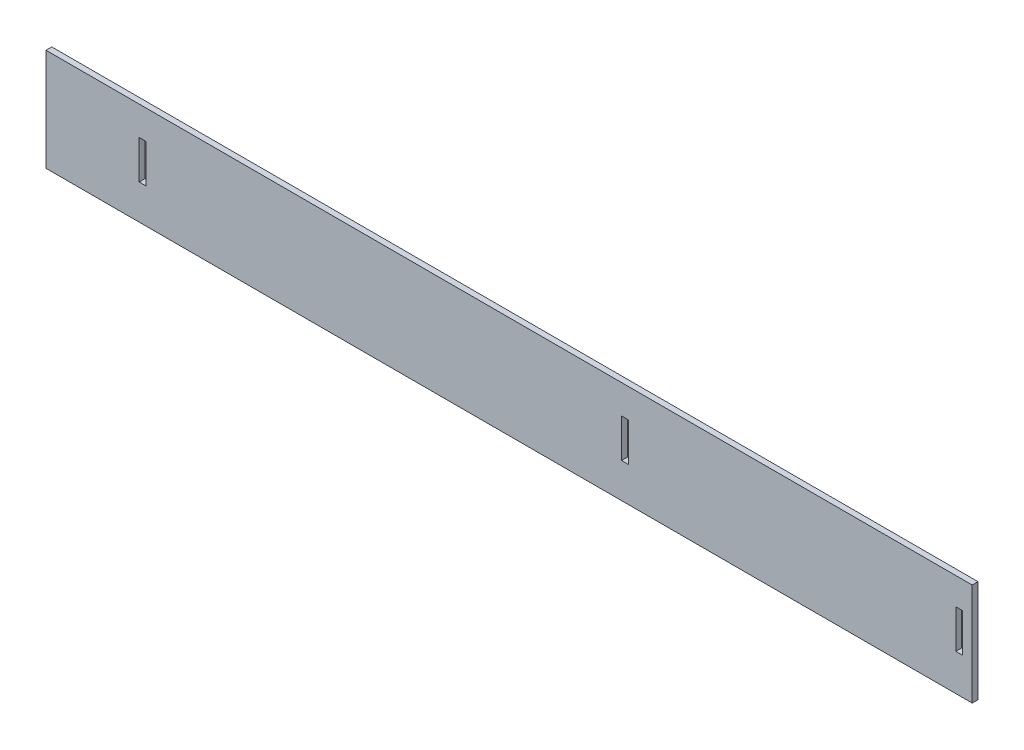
from build123d import *

# Parameters (mm, degrees)
ESQUISSE1_W        = 3.5
ESQUISSE1_H        = 20
BOSS_EXTRU_1_DEPTH = 3


with BuildPart() as part:
    # Esquisse1 → Boss.-Extru.1 (new body)
    with BuildSketch(Plane.XY):
        Polygon((0, 50), (480, 50), (480, -3), (0, -3), (0, 0), align=None)
        with Locations((50, 25)):
            Rectangle(ESQUISSE1_W, ESQUISSE1_H, mode=Mode.SUBTRACT)
        with Locations((300, 25)):
            Rectangle(ESQUISSE1_W, ESQUISSE1_H, mode=Mode.SUBTRACT)
        with Locations((473.25, 25.972081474)):
            Rectangle(ESQUISSE1_W, ESQUISSE1_H, mode=Mode.SUBTRACT)
    extrude(amount=BOSS_EXTRU_1_DEPTH)


solid = part.part
